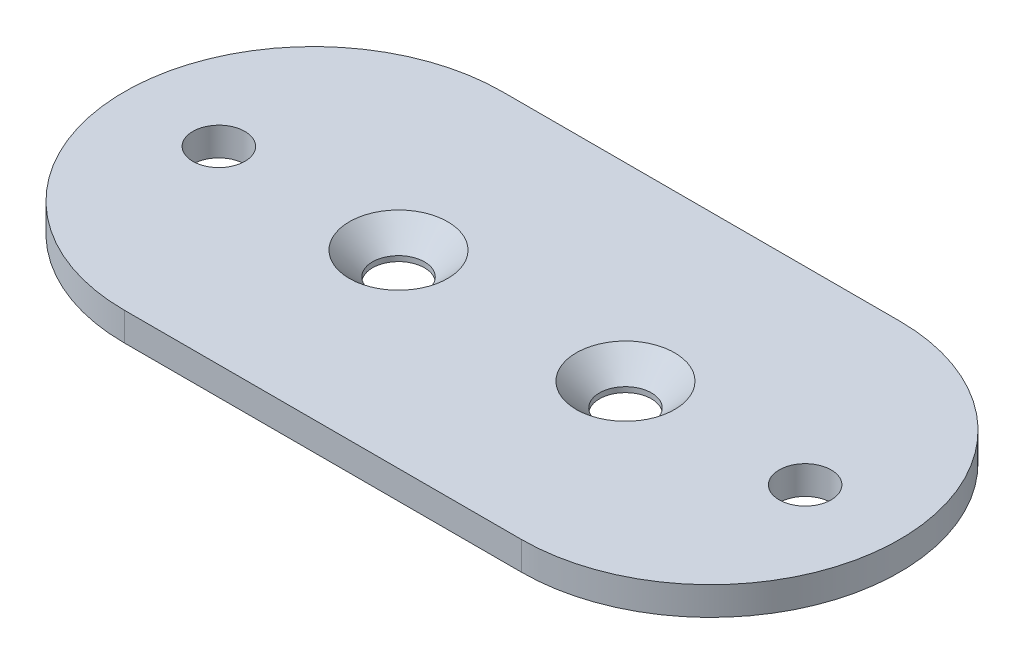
from build123d import *

# Parameters (mm, degrees)
SKETCH1_R                                    = 2.75
BOSS_EXTRUDE1_DEPTH                          = 3
CSK_FOR_M5_COUNTERSUNK_FLAT_HEAD_SCR_2_COUNT = 2
CSK_FOR_M5_COUNTERSUNK_FLAT_HEAD_SCR_2_PITCH = 24


with BuildPart() as part:
    # Sketch1 → Boss-Extrude1 (new body)
    with BuildSketch(Plane(origin=(0, 0, 0), x_dir=(1, 0, 0), z_dir=(0, 1, 0))):
        with BuildLine():
            Line((0, 20), (42, 20))
            ThreePointArc((42, 20), (62, 0), (42, -20))
            Line((42, -20), (0, -20))
            ThreePointArc((0, -20), (-20, 0), (0, 20))
        make_face()
        with Locations(Location((-10, 0, 0), (0, 0, 270))):
            Circle(SKETCH1_R, mode=Mode.SUBTRACT)
        with Locations(Location((52, 0, 0), (0, 0, 270))):
            Circle(SKETCH1_R, mode=Mode.SUBTRACT)
    extrude(amount=BOSS_EXTRUDE1_DEPTH)

    # Sketch3 → CSK for M5 Countersunk Flat Head Screw1 (revolve, cut)
    with BuildSketch(Plane(origin=(33, 3, 0), x_dir=(0, 0, 1), z_dir=(1, 0, 0))):
        Polygon((0, 0), (0, 3), (2.75, 3), (2.75, 2.45), (5.2, 0), align=None)
    csk_for_m5_countersunk_flat_head_screw1 = revolve(axis=Axis((33, 9.35, 0), (0, -1, 0)), mode=Mode.SUBTRACT)

    # CSK for M5 Countersunk Flat Head Scr 2: CSK for M5 Countersunk Flat Head Screw1 ×2
    with Locations(*[(-i * CSK_FOR_M5_COUNTERSUNK_FLAT_HEAD_SCR_2_PITCH, 0, 0) for i in range(1, CSK_FOR_M5_COUNTERSUNK_FLAT_HEAD_SCR_2_COUNT)]):
        add(csk_for_m5_countersunk_flat_head_screw1, mode=Mode.SUBTRACT)


solid = part.part
